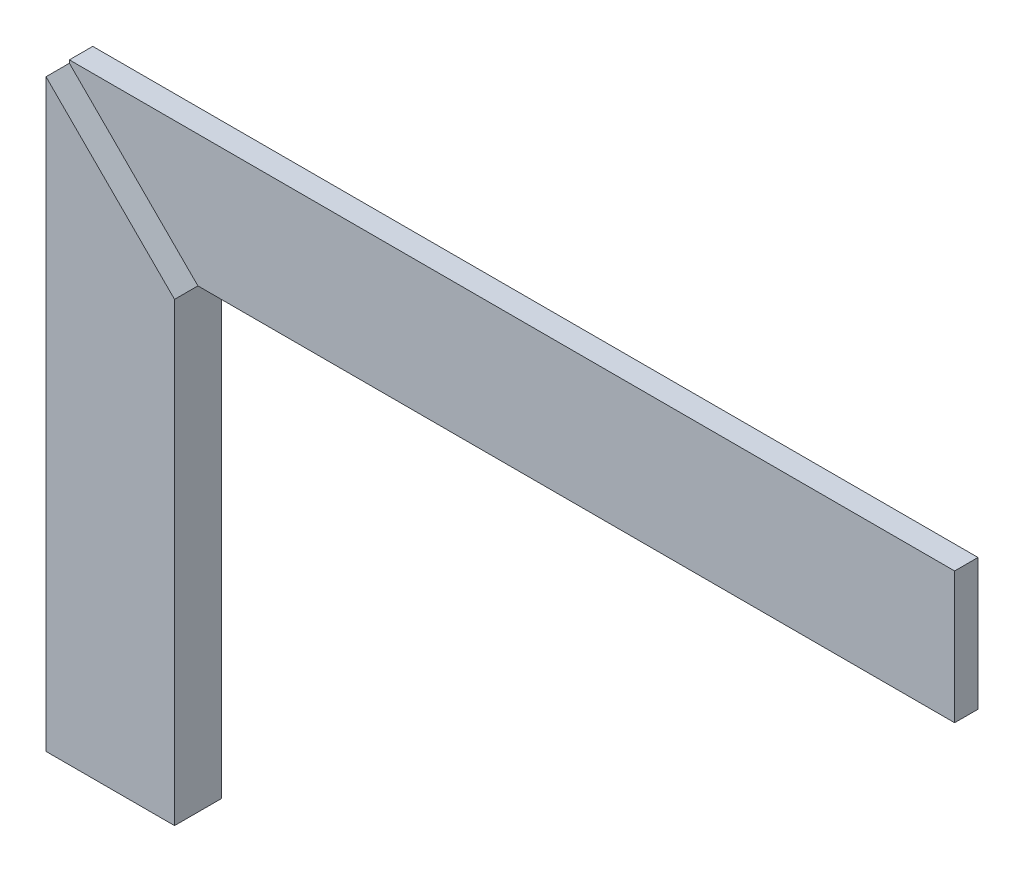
from build123d import *

# Parameters (mm, degrees)
BOSS_EXTRU_1_DEPTH      = 16
ENL_V_MAT_EXTRU_1_DEPTH = 8


with BuildPart() as part:
    # Esquisse1 → Boss.-Extru.1 (new body)
    with BuildSketch(Plane.XY):
        Polygon((0, 0), (303, 0), (303, -45), (44, -45), (44, -201), (0, -201), align=None)
    extrude(amount=BOSS_EXTRU_1_DEPTH)

    # Esquisse2 → Enl_v. mat.-Extru.1 (cut)
    with BuildSketch(Plane.XY.offset(16)):
        Polygon((44, -45), (0, -1), (0, 0), (303, 0), (303, -45), align=None)
    extrude(amount=-ENL_V_MAT_EXTRU_1_DEPTH, mode=Mode.SUBTRACT)


solid = part.part
